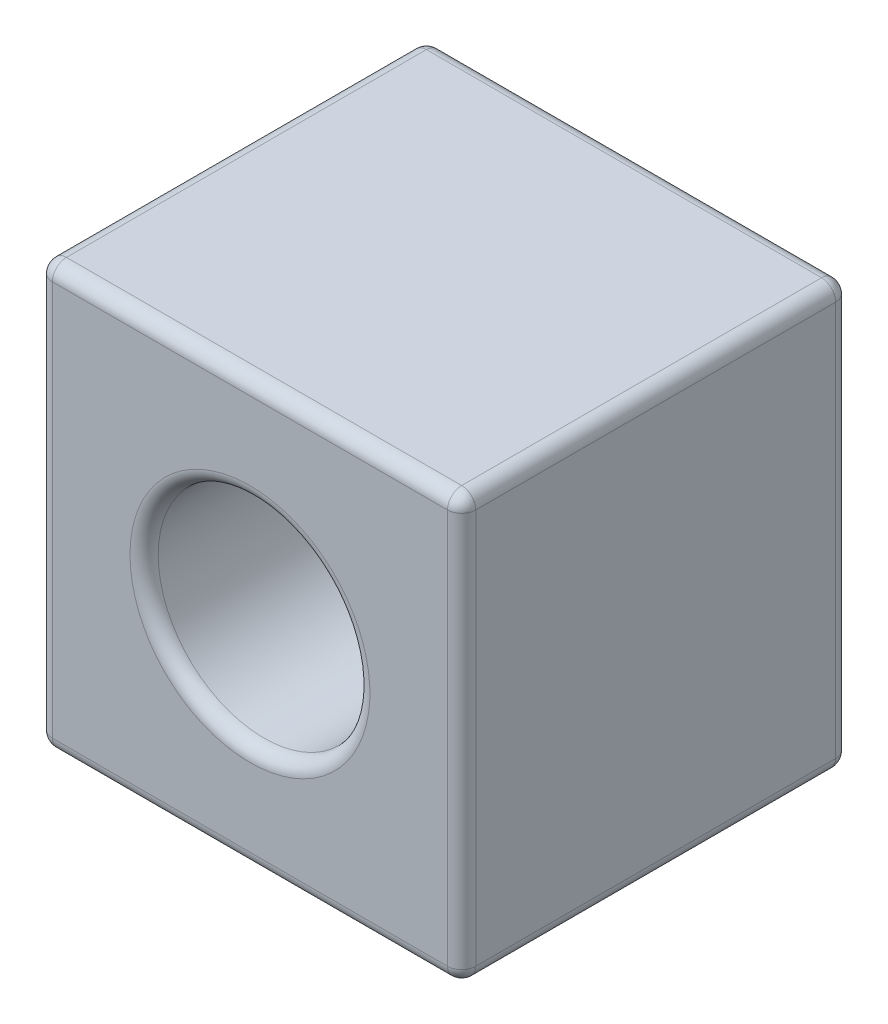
ISO-10303-21;
HEADER;
FILE_DESCRIPTION(('STEP AP214'),'2;1');
FILE_NAME('part.step','',(''),(''),'','','');
FILE_SCHEMA(('AUTOMOTIVE_DESIGN { 1 0 10303 214 1 1 1 1 }'));
ENDSEC;
DATA;
#1=APPLICATION_CONTEXT('core data for automotive mechanical design processes');
#2=APPLICATION_PROTOCOL_DEFINITION('international standard','automotive_design',2000,#1);
#3=PRODUCT_CONTEXT('',#1,'mechanical');
#4=PRODUCT('Part','Part','',(#3));
#5=PRODUCT_RELATED_PRODUCT_CATEGORY('part','',(#4));
#6=PRODUCT_DEFINITION_FORMATION('','',#4);
#7=PRODUCT_DEFINITION_CONTEXT('part definition',#1,'design');
#8=PRODUCT_DEFINITION('design','',#6,#7);
#9=PRODUCT_DEFINITION_SHAPE('','',#8);
#10=(LENGTH_UNIT() NAMED_UNIT(*) SI_UNIT(.MILLI.,.METRE.));
#11=(NAMED_UNIT(*) PLANE_ANGLE_UNIT() SI_UNIT($,.RADIAN.));
#12=(NAMED_UNIT(*) SI_UNIT($,.STERADIAN.) SOLID_ANGLE_UNIT());
#13=UNCERTAINTY_MEASURE_WITH_UNIT(LENGTH_MEASURE(1.E-05),#10,'distance_accuracy_value','');
#14=(GEOMETRIC_REPRESENTATION_CONTEXT(3) GLOBAL_UNCERTAINTY_ASSIGNED_CONTEXT((#13)) GLOBAL_UNIT_ASSIGNED_CONTEXT((#10,
#11,#12)) REPRESENTATION_CONTEXT('',''));
#15=CARTESIAN_POINT('',(0.,0.,0.));
#16=DIRECTION('',(0.,0.,1.));
#17=DIRECTION('',(1.,0.,0.));
#18=AXIS2_PLACEMENT_3D('',#15,#16,#17);
#19=CARTESIAN_POINT('',(-2.8,2.8,5.5));
#20=DIRECTION('',(0.,0.,-1.));
#21=DIRECTION('',(-1.,0.,0.));
#22=AXIS2_PLACEMENT_3D('',#19,#20,#21);
#23=PLANE('',#22);
#24=CARTESIAN_POINT('',(0.,0.,5.5));
#25=DIRECTION('',(0.,0.,-1.));
#26=DIRECTION('',(-1.,0.,0.));
#27=AXIS2_PLACEMENT_3D('',#24,#25,#26);
#28=CIRCLE('',#27,1.7);
#29=CARTESIAN_POINT('',(-1.7,0.,5.5));
#30=VERTEX_POINT('',#29);
#31=EDGE_CURVE('E11',#30,#30,#28,.T.);
#32=ORIENTED_EDGE('',*,*,#31,.T.);
#33=EDGE_LOOP('',(#32));
#34=FACE_BOUND('',#33,.T.);
#35=DIRECTION('',(0.,1.,0.));
#36=VECTOR('',#35,1.);
#37=CARTESIAN_POINT('',(2.8,2.8,5.5));
#38=LINE('',#37,#36);
#39=CARTESIAN_POINT('',(2.8,-2.8,5.5));
#40=VERTEX_POINT('',#39);
#41=CARTESIAN_POINT('',(2.8,2.8,5.5));
#42=VERTEX_POINT('',#41);
#43=EDGE_CURVE('E48',#40,#42,#38,.T.);
#44=ORIENTED_EDGE('',*,*,#43,.T.);
#45=DIRECTION('',(-1.,0.,0.));
#46=VECTOR('',#45,1.);
#47=CARTESIAN_POINT('',(-2.8,2.8,5.5));
#48=LINE('',#47,#46);
#49=CARTESIAN_POINT('',(-2.8,2.8,5.5));
#50=VERTEX_POINT('',#49);
#51=EDGE_CURVE('E41',#42,#50,#48,.T.);
#52=ORIENTED_EDGE('',*,*,#51,.T.);
#53=DIRECTION('',(0.,-1.,0.));
#54=VECTOR('',#53,1.);
#55=CARTESIAN_POINT('',(-2.8,2.8,5.5));
#56=LINE('',#55,#54);
#57=CARTESIAN_POINT('',(-2.8,-2.8,5.5));
#58=VERTEX_POINT('',#57);
#59=EDGE_CURVE('E204',#50,#58,#56,.T.);
#60=ORIENTED_EDGE('',*,*,#59,.T.);
#61=DIRECTION('',(1.,0.,0.));
#62=VECTOR('',#61,1.);
#63=CARTESIAN_POINT('',(-2.8,-2.8,5.5));
#64=LINE('',#63,#62);
#65=EDGE_CURVE('E53',#58,#40,#64,.T.);
#66=ORIENTED_EDGE('',*,*,#65,.T.);
#67=EDGE_LOOP('',(#44,#52,#60,#66));
#68=FACE_BOUND('',#67,.T.);
#69=ADVANCED_FACE('F33',(#34,#68),#23,.F.);
#70=CARTESIAN_POINT('',(-2.8,2.8,0.));
#71=DIRECTION('',(0.,0.,-1.));
#72=DIRECTION('',(-1.,0.,0.));
#73=AXIS2_PLACEMENT_3D('',#70,#71,#72);
#74=PLANE('',#73);
#75=CARTESIAN_POINT('',(0.,0.,0.));
#76=DIRECTION('',(0.,0.,-1.));
#77=DIRECTION('',(-1.,0.,0.));
#78=AXIS2_PLACEMENT_3D('',#75,#76,#77);
#79=CIRCLE('',#78,1.7);
#80=CARTESIAN_POINT('',(-1.7,0.,0.));
#81=VERTEX_POINT('',#80);
#82=EDGE_CURVE('E159',#81,#81,#79,.F.);
#83=ORIENTED_EDGE('',*,*,#82,.T.);
#84=EDGE_LOOP('',(#83));
#85=FACE_BOUND('',#84,.T.);
#86=DIRECTION('',(1.,0.,0.));
#87=VECTOR('',#86,1.);
#88=CARTESIAN_POINT('',(-2.8,-2.8,0.));
#89=LINE('',#88,#87);
#90=CARTESIAN_POINT('',(2.8,-2.8,0.));
#91=VERTEX_POINT('',#90);
#92=CARTESIAN_POINT('',(-2.8,-2.8,0.));
#93=VERTEX_POINT('',#92);
#94=EDGE_CURVE('E157',#91,#93,#89,.F.);
#95=ORIENTED_EDGE('',*,*,#94,.T.);
#96=DIRECTION('',(0.,-1.,0.));
#97=VECTOR('',#96,1.);
#98=CARTESIAN_POINT('',(-2.8,2.8,0.));
#99=LINE('',#98,#97);
#100=CARTESIAN_POINT('',(-2.8,2.8,0.));
#101=VERTEX_POINT('',#100);
#102=EDGE_CURVE('E127',#93,#101,#99,.F.);
#103=ORIENTED_EDGE('',*,*,#102,.T.);
#104=DIRECTION('',(-1.,0.,0.));
#105=VECTOR('',#104,1.);
#106=CARTESIAN_POINT('',(2.8,2.8,0.));
#107=LINE('',#106,#105);
#108=CARTESIAN_POINT('',(2.8,2.8,0.));
#109=VERTEX_POINT('',#108);
#110=EDGE_CURVE('E146',#101,#109,#107,.F.);
#111=ORIENTED_EDGE('',*,*,#110,.T.);
#112=DIRECTION('',(0.,1.,0.));
#113=VECTOR('',#112,1.);
#114=CARTESIAN_POINT('',(2.8,-2.8,0.));
#115=LINE('',#114,#113);
#116=EDGE_CURVE('E152',#109,#91,#115,.F.);
#117=ORIENTED_EDGE('',*,*,#116,.T.);
#118=EDGE_LOOP('',(#95,#103,#111,#117));
#119=FACE_BOUND('',#118,.T.);
#120=ADVANCED_FACE('F155',(#85,#119),#74,.T.);
#121=CARTESIAN_POINT('',(-2.8,2.8,5.5));
#122=DIRECTION('',(0.,0.,-1.));
#123=DIRECTION('',(-1.,0.,0.));
#124=AXIS2_PLACEMENT_3D('',#121,#122,#123);
#125=CYLINDRICAL_SURFACE('',#124,0.2);
#126=DIRECTION('',(0.,0.,-1.));
#127=VECTOR('',#126,1.);
#128=CARTESIAN_POINT('',(-2.8,3.,5.5));
#129=LINE('',#128,#127);
#130=CARTESIAN_POINT('',(-2.8,3.,5.3));
#131=VERTEX_POINT('',#130);
#132=CARTESIAN_POINT('',(-2.8,3.,0.2));
#133=VERTEX_POINT('',#132);
#134=EDGE_CURVE('E259',#131,#133,#129,.T.);
#135=ORIENTED_EDGE('',*,*,#134,.T.);
#136=CARTESIAN_POINT('',(-2.8,2.8,0.2));
#137=DIRECTION('',(0.,0.,-1.));
#138=DIRECTION('',(-1.,0.,0.));
#139=AXIS2_PLACEMENT_3D('',#136,#137,#138);
#140=CIRCLE('',#139,0.2);
#141=CARTESIAN_POINT('',(-3.,2.8,0.2));
#142=VERTEX_POINT('',#141);
#143=EDGE_CURVE('E140',#133,#142,#140,.F.);
#144=ORIENTED_EDGE('',*,*,#143,.T.);
#145=DIRECTION('',(0.,0.,-1.));
#146=VECTOR('',#145,1.);
#147=CARTESIAN_POINT('',(-3.,2.8,5.5));
#148=LINE('',#147,#146);
#149=CARTESIAN_POINT('',(-3.,2.8,5.3));
#150=VERTEX_POINT('',#149);
#151=EDGE_CURVE('E153',#150,#142,#148,.T.);
#152=ORIENTED_EDGE('',*,*,#151,.F.);
#153=CARTESIAN_POINT('',(-2.8,2.8,5.3));
#154=DIRECTION('',(0.,0.,-1.));
#155=DIRECTION('',(-1.,0.,0.));
#156=AXIS2_PLACEMENT_3D('',#153,#154,#155);
#157=CIRCLE('',#156,0.2);
#158=EDGE_CURVE('E201',#150,#131,#157,.T.);
#159=ORIENTED_EDGE('',*,*,#158,.T.);
#160=EDGE_LOOP('',(#135,#144,#152,#159));
#161=FACE_BOUND('',#160,.T.);
#162=ADVANCED_FACE('F35',(#161),#125,.T.);
#163=CARTESIAN_POINT('',(-3.,2.8,5.5));
#164=DIRECTION('',(1.,0.,0.));
#165=DIRECTION('',(0.,0.,-1.));
#166=AXIS2_PLACEMENT_3D('',#163,#164,#165);
#167=PLANE('',#166);
#168=ORIENTED_EDGE('',*,*,#151,.T.);
#169=DIRECTION('',(0.,-1.,0.));
#170=VECTOR('',#169,1.);
#171=CARTESIAN_POINT('',(-3.,-2.8,0.2));
#172=LINE('',#171,#170);
#173=CARTESIAN_POINT('',(-3.,-2.8,0.2));
#174=VERTEX_POINT('',#173);
#175=EDGE_CURVE('E130',#142,#174,#172,.T.);
#176=ORIENTED_EDGE('',*,*,#175,.T.);
#177=DIRECTION('',(0.,0.,-1.));
#178=VECTOR('',#177,1.);
#179=CARTESIAN_POINT('',(-3.,-2.8,5.5));
#180=LINE('',#179,#178);
#181=CARTESIAN_POINT('',(-3.,-2.8,5.3));
#182=VERTEX_POINT('',#181);
#183=EDGE_CURVE('E277',#182,#174,#180,.T.);
#184=ORIENTED_EDGE('',*,*,#183,.F.);
#185=DIRECTION('',(0.,-1.,0.));
#186=VECTOR('',#185,1.);
#187=CARTESIAN_POINT('',(-3.,2.8,5.3));
#188=LINE('',#187,#186);
#189=EDGE_CURVE('E173',#182,#150,#188,.F.);
#190=ORIENTED_EDGE('',*,*,#189,.T.);
#191=EDGE_LOOP('',(#168,#176,#184,#190));
#192=FACE_BOUND('',#191,.T.);
#193=ADVANCED_FACE('F300',(#192),#167,.F.);
#194=CARTESIAN_POINT('',(-2.8,-2.8,5.5));
#195=DIRECTION('',(0.,0.,-1.));
#196=DIRECTION('',(-1.,0.,0.));
#197=AXIS2_PLACEMENT_3D('',#194,#195,#196);
#198=CYLINDRICAL_SURFACE('',#197,0.2);
#199=ORIENTED_EDGE('',*,*,#183,.T.);
#200=CARTESIAN_POINT('',(-2.8,-2.8,0.2));
#201=DIRECTION('',(0.,0.,-1.));
#202=DIRECTION('',(-1.,0.,0.));
#203=AXIS2_PLACEMENT_3D('',#200,#201,#202);
#204=CIRCLE('',#203,0.2);
#205=CARTESIAN_POINT('',(-2.8,-3.,0.2));
#206=VERTEX_POINT('',#205);
#207=EDGE_CURVE('E178',#174,#206,#204,.F.);
#208=ORIENTED_EDGE('',*,*,#207,.T.);
#209=DIRECTION('',(0.,0.,-1.));
#210=VECTOR('',#209,1.);
#211=CARTESIAN_POINT('',(-2.8,-3.,5.5));
#212=LINE('',#211,#210);
#213=CARTESIAN_POINT('',(-2.8,-3.,5.3));
#214=VERTEX_POINT('',#213);
#215=EDGE_CURVE('E274',#214,#206,#212,.T.);
#216=ORIENTED_EDGE('',*,*,#215,.F.);
#217=CARTESIAN_POINT('',(-2.8,-2.8,5.3));
#218=DIRECTION('',(0.,0.,-1.));
#219=DIRECTION('',(-1.,0.,0.));
#220=AXIS2_PLACEMENT_3D('',#217,#218,#219);
#221=CIRCLE('',#220,0.2);
#222=EDGE_CURVE('E176',#214,#182,#221,.T.);
#223=ORIENTED_EDGE('',*,*,#222,.T.);
#224=EDGE_LOOP('',(#199,#208,#216,#223));
#225=FACE_BOUND('',#224,.T.);
#226=ADVANCED_FACE('F302',(#225),#198,.T.);
#227=CARTESIAN_POINT('',(-2.8,-3.,5.5));
#228=DIRECTION('',(0.,1.,0.));
#229=DIRECTION('',(0.,0.,1.));
#230=AXIS2_PLACEMENT_3D('',#227,#228,#229);
#231=PLANE('',#230);
#232=ORIENTED_EDGE('',*,*,#215,.T.);
#233=DIRECTION('',(1.,0.,0.));
#234=VECTOR('',#233,1.);
#235=CARTESIAN_POINT('',(2.8,-3.,0.2));
#236=LINE('',#235,#234);
#237=CARTESIAN_POINT('',(2.8,-3.,0.2));
#238=VERTEX_POINT('',#237);
#239=EDGE_CURVE('E182',#206,#238,#236,.T.);
#240=ORIENTED_EDGE('',*,*,#239,.T.);
#241=DIRECTION('',(0.,0.,-1.));
#242=VECTOR('',#241,1.);
#243=CARTESIAN_POINT('',(2.8,-3.,5.5));
#244=LINE('',#243,#242);
#245=CARTESIAN_POINT('',(2.8,-3.,5.3));
#246=VERTEX_POINT('',#245);
#247=EDGE_CURVE('E271',#246,#238,#244,.T.);
#248=ORIENTED_EDGE('',*,*,#247,.F.);
#249=DIRECTION('',(1.,0.,0.));
#250=VECTOR('',#249,1.);
#251=CARTESIAN_POINT('',(-2.8,-3.,5.3));
#252=LINE('',#251,#250);
#253=EDGE_CURVE('E180',#246,#214,#252,.F.);
#254=ORIENTED_EDGE('',*,*,#253,.T.);
#255=EDGE_LOOP('',(#232,#240,#248,#254));
#256=FACE_BOUND('',#255,.T.);
#257=ADVANCED_FACE('F355',(#256),#231,.F.);
#258=CARTESIAN_POINT('',(2.8,-2.8,5.5));
#259=DIRECTION('',(0.,0.,-1.));
#260=DIRECTION('',(-1.,0.,0.));
#261=AXIS2_PLACEMENT_3D('',#258,#259,#260);
#262=CYLINDRICAL_SURFACE('',#261,0.2);
#263=ORIENTED_EDGE('',*,*,#247,.T.);
#264=CARTESIAN_POINT('',(2.8,-2.8,0.2));
#265=DIRECTION('',(0.,0.,-1.));
#266=DIRECTION('',(-1.,0.,0.));
#267=AXIS2_PLACEMENT_3D('',#264,#265,#266);
#268=CIRCLE('',#267,0.2);
#269=CARTESIAN_POINT('',(3.,-2.8,0.2));
#270=VERTEX_POINT('',#269);
#271=EDGE_CURVE('E186',#238,#270,#268,.F.);
#272=ORIENTED_EDGE('',*,*,#271,.T.);
#273=DIRECTION('',(0.,0.,-1.));
#274=VECTOR('',#273,1.);
#275=CARTESIAN_POINT('',(3.,-2.8,5.5));
#276=LINE('',#275,#274);
#277=CARTESIAN_POINT('',(3.,-2.8,5.3));
#278=VERTEX_POINT('',#277);
#279=EDGE_CURVE('E268',#278,#270,#276,.T.);
#280=ORIENTED_EDGE('',*,*,#279,.F.);
#281=CARTESIAN_POINT('',(2.8,-2.8,5.3));
#282=DIRECTION('',(0.,0.,-1.));
#283=DIRECTION('',(-1.,0.,0.));
#284=AXIS2_PLACEMENT_3D('',#281,#282,#283);
#285=CIRCLE('',#284,0.2);
#286=EDGE_CURVE('E184',#278,#246,#285,.T.);
#287=ORIENTED_EDGE('',*,*,#286,.T.);
#288=EDGE_LOOP('',(#263,#272,#280,#287));
#289=FACE_BOUND('',#288,.T.);
#290=ADVANCED_FACE('F351',(#289),#262,.T.);
#291=CARTESIAN_POINT('',(3.,2.8,5.5));
#292=DIRECTION('',(-1.,0.,0.));
#293=DIRECTION('',(0.,0.,1.));
#294=AXIS2_PLACEMENT_3D('',#291,#292,#293);
#295=PLANE('',#294);
#296=ORIENTED_EDGE('',*,*,#279,.T.);
#297=DIRECTION('',(0.,1.,0.));
#298=VECTOR('',#297,1.);
#299=CARTESIAN_POINT('',(3.,2.8,0.2));
#300=LINE('',#299,#298);
#301=CARTESIAN_POINT('',(3.,2.8,0.2));
#302=VERTEX_POINT('',#301);
#303=EDGE_CURVE('E190',#270,#302,#300,.T.);
#304=ORIENTED_EDGE('',*,*,#303,.T.);
#305=DIRECTION('',(0.,0.,-1.));
#306=VECTOR('',#305,1.);
#307=CARTESIAN_POINT('',(3.,2.8,5.5));
#308=LINE('',#307,#306);
#309=CARTESIAN_POINT('',(3.,2.8,5.3));
#310=VERTEX_POINT('',#309);
#311=EDGE_CURVE('E265',#310,#302,#308,.T.);
#312=ORIENTED_EDGE('',*,*,#311,.F.);
#313=DIRECTION('',(0.,1.,0.));
#314=VECTOR('',#313,1.);
#315=CARTESIAN_POINT('',(3.,2.8,5.3));
#316=LINE('',#315,#314);
#317=EDGE_CURVE('E188',#310,#278,#316,.F.);
#318=ORIENTED_EDGE('',*,*,#317,.T.);
#319=EDGE_LOOP('',(#296,#304,#312,#318));
#320=FACE_BOUND('',#319,.T.);
#321=ADVANCED_FACE('F348',(#320),#295,.F.);
#322=CARTESIAN_POINT('',(2.8,2.8,5.5));
#323=DIRECTION('',(0.,0.,-1.));
#324=DIRECTION('',(-1.,0.,0.));
#325=AXIS2_PLACEMENT_3D('',#322,#323,#324);
#326=CYLINDRICAL_SURFACE('',#325,0.2);
#327=ORIENTED_EDGE('',*,*,#311,.T.);
#328=CARTESIAN_POINT('',(2.8,2.8,0.2));
#329=DIRECTION('',(0.,0.,-1.));
#330=DIRECTION('',(-1.,0.,0.));
#331=AXIS2_PLACEMENT_3D('',#328,#329,#330);
#332=CIRCLE('',#331,0.2);
#333=CARTESIAN_POINT('',(2.8,3.,0.2));
#334=VERTEX_POINT('',#333);
#335=EDGE_CURVE('E194',#302,#334,#332,.F.);
#336=ORIENTED_EDGE('',*,*,#335,.T.);
#337=DIRECTION('',(0.,0.,-1.));
#338=VECTOR('',#337,1.);
#339=CARTESIAN_POINT('',(2.8,3.,5.5));
#340=LINE('',#339,#338);
#341=CARTESIAN_POINT('',(2.8,3.,5.3));
#342=VERTEX_POINT('',#341);
#343=EDGE_CURVE('E262',#342,#334,#340,.T.);
#344=ORIENTED_EDGE('',*,*,#343,.F.);
#345=CARTESIAN_POINT('',(2.8,2.8,5.3));
#346=DIRECTION('',(0.,0.,-1.));
#347=DIRECTION('',(-1.,0.,0.));
#348=AXIS2_PLACEMENT_3D('',#345,#346,#347);
#349=CIRCLE('',#348,0.2);
#350=EDGE_CURVE('E192',#342,#310,#349,.T.);
#351=ORIENTED_EDGE('',*,*,#350,.T.);
#352=EDGE_LOOP('',(#327,#336,#344,#351));
#353=FACE_BOUND('',#352,.T.);
#354=ADVANCED_FACE('F324',(#353),#326,.T.);
#355=CARTESIAN_POINT('',(-2.8,3.,5.5));
#356=DIRECTION('',(0.,-1.,0.));
#357=DIRECTION('',(0.,0.,-1.));
#358=AXIS2_PLACEMENT_3D('',#355,#356,#357);
#359=PLANE('',#358);
#360=ORIENTED_EDGE('',*,*,#343,.T.);
#361=DIRECTION('',(-1.,0.,0.));
#362=VECTOR('',#361,1.);
#363=CARTESIAN_POINT('',(-2.8,3.,0.2));
#364=LINE('',#363,#362);
#365=EDGE_CURVE('E199',#334,#133,#364,.T.);
#366=ORIENTED_EDGE('',*,*,#365,.T.);
#367=ORIENTED_EDGE('',*,*,#134,.F.);
#368=DIRECTION('',(-1.,0.,0.));
#369=VECTOR('',#368,1.);
#370=CARTESIAN_POINT('',(-2.8,3.,5.3));
#371=LINE('',#370,#369);
#372=EDGE_CURVE('E196',#131,#342,#371,.F.);
#373=ORIENTED_EDGE('',*,*,#372,.T.);
#374=EDGE_LOOP('',(#360,#366,#367,#373));
#375=FACE_BOUND('',#374,.T.);
#376=ADVANCED_FACE('F323',(#375),#359,.F.);
#377=CARTESIAN_POINT('',(0.,0.,5.5));
#378=DIRECTION('',(0.,0.,-1.));
#379=DIRECTION('',(-1.,0.,0.));
#380=AXIS2_PLACEMENT_3D('',#377,#378,#379);
#381=CYLINDRICAL_SURFACE('',#380,1.5);
#382=CARTESIAN_POINT('',(0.,0.,0.2));
#383=DIRECTION('',(0.,0.,-1.));
#384=DIRECTION('',(-1.,0.,0.));
#385=AXIS2_PLACEMENT_3D('',#382,#383,#384);
#386=CIRCLE('',#385,1.5);
#387=CARTESIAN_POINT('',(-1.5,0.,0.2));
#388=VERTEX_POINT('',#387);
#389=EDGE_CURVE('E169',#388,#388,#386,.T.);
#390=ORIENTED_EDGE('',*,*,#389,.T.);
#391=EDGE_LOOP('',(#390));
#392=FACE_BOUND('',#391,.T.);
#393=CARTESIAN_POINT('',(0.,0.,5.3));
#394=DIRECTION('',(0.,0.,-1.));
#395=DIRECTION('',(-1.,0.,0.));
#396=AXIS2_PLACEMENT_3D('',#393,#394,#395);
#397=CIRCLE('',#396,1.5);
#398=CARTESIAN_POINT('',(-1.5,0.,5.3));
#399=VERTEX_POINT('',#398);
#400=EDGE_CURVE('E162',#399,#399,#397,.F.);
#401=ORIENTED_EDGE('',*,*,#400,.T.);
#402=EDGE_LOOP('',(#401));
#403=FACE_BOUND('',#402,.T.);
#404=ADVANCED_FACE('F345',(#392,#403),#381,.F.);
#405=CARTESIAN_POINT('',(0.,0.,0.2));
#406=DIRECTION('',(0.,0.,-1.));
#407=DIRECTION('',(-1.,0.,0.));
#408=AXIS2_PLACEMENT_3D('',#405,#406,#407);
#409=TOROIDAL_SURFACE('',#408,1.7,0.2);
#410=ORIENTED_EDGE('',*,*,#389,.F.);
#411=EDGE_LOOP('',(#410));
#412=FACE_BOUND('',#411,.T.);
#413=ORIENTED_EDGE('',*,*,#82,.F.);
#414=EDGE_LOOP('',(#413));
#415=FACE_BOUND('',#414,.T.);
#416=ADVANCED_FACE('F392',(#412,#415),#409,.T.);
#417=CARTESIAN_POINT('',(2.8,2.8,0.2));
#418=DIRECTION('',(0.,-1.,0.));
#419=DIRECTION('',(0.,0.,-1.));
#420=AXIS2_PLACEMENT_3D('',#417,#418,#419);
#421=CYLINDRICAL_SURFACE('',#420,0.2);
#422=CARTESIAN_POINT('',(2.8,2.8,0.2));
#423=DIRECTION('',(0.,1.,0.));
#424=DIRECTION('',(0.,0.,1.));
#425=AXIS2_PLACEMENT_3D('',#422,#423,#424);
#426=CIRCLE('',#425,0.2);
#427=EDGE_CURVE('E256',#302,#109,#426,.T.);
#428=ORIENTED_EDGE('',*,*,#427,.F.);
#429=ORIENTED_EDGE('',*,*,#303,.F.);
#430=CARTESIAN_POINT('',(2.8,-2.8,0.2));
#431=DIRECTION('',(0.,-1.,0.));
#432=DIRECTION('',(1.,0.,0.));
#433=AXIS2_PLACEMENT_3D('',#430,#431,#432);
#434=CIRCLE('',#433,0.2);
#435=EDGE_CURVE('E253',#91,#270,#434,.T.);
#436=ORIENTED_EDGE('',*,*,#435,.F.);
#437=ORIENTED_EDGE('',*,*,#116,.F.);
#438=EDGE_LOOP('',(#428,#429,#436,#437));
#439=FACE_BOUND('',#438,.T.);
#440=ADVANCED_FACE('F286',(#439),#421,.T.);
#441=CARTESIAN_POINT('',(2.8,2.8,0.2));
#442=DIRECTION('',(0.,0.,1.));
#443=DIRECTION('',(1.,0.,0.));
#444=AXIS2_PLACEMENT_3D('',#441,#442,#443);
#445=SPHERICAL_SURFACE('',#444,0.2);
#446=ORIENTED_EDGE('',*,*,#335,.F.);
#447=ORIENTED_EDGE('',*,*,#427,.T.);
#448=CARTESIAN_POINT('',(2.8,2.8,0.2));
#449=DIRECTION('',(-1.,0.,0.));
#450=DIRECTION('',(0.,-1.,0.));
#451=AXIS2_PLACEMENT_3D('',#448,#449,#450);
#452=CIRCLE('',#451,0.2);
#453=EDGE_CURVE('E149',#334,#109,#452,.T.);
#454=ORIENTED_EDGE('',*,*,#453,.F.);
#455=EDGE_LOOP('',(#446,#447,#454));
#456=FACE_BOUND('',#455,.T.);
#457=ADVANCED_FACE('F327',(#456),#445,.T.);
#458=CARTESIAN_POINT('',(2.8,-2.8,0.2));
#459=DIRECTION('',(0.,0.,1.));
#460=DIRECTION('',(1.,0.,0.));
#461=AXIS2_PLACEMENT_3D('',#458,#459,#460);
#462=SPHERICAL_SURFACE('',#461,0.2);
#463=ORIENTED_EDGE('',*,*,#435,.T.);
#464=ORIENTED_EDGE('',*,*,#271,.F.);
#465=CARTESIAN_POINT('',(2.8,-2.8,0.2));
#466=DIRECTION('',(-1.,0.,0.));
#467=DIRECTION('',(0.,-1.,0.));
#468=AXIS2_PLACEMENT_3D('',#465,#466,#467);
#469=CIRCLE('',#468,0.2);
#470=EDGE_CURVE('E143',#91,#238,#469,.T.);
#471=ORIENTED_EDGE('',*,*,#470,.F.);
#472=EDGE_LOOP('',(#463,#464,#471));
#473=FACE_BOUND('',#472,.T.);
#474=ADVANCED_FACE('F289',(#473),#462,.T.);
#475=CARTESIAN_POINT('',(-2.8,2.8,0.2));
#476=DIRECTION('',(1.,0.,0.));
#477=DIRECTION('',(0.,0.,-1.));
#478=AXIS2_PLACEMENT_3D('',#475,#476,#477);
#479=CYLINDRICAL_SURFACE('',#478,0.2);
#480=ORIENTED_EDGE('',*,*,#453,.T.);
#481=ORIENTED_EDGE('',*,*,#110,.F.);
#482=CARTESIAN_POINT('',(-2.8,2.8,0.2));
#483=DIRECTION('',(-1.,0.,0.));
#484=DIRECTION('',(0.,0.,1.));
#485=AXIS2_PLACEMENT_3D('',#482,#483,#484);
#486=CIRCLE('',#485,0.2);
#487=EDGE_CURVE('E137',#133,#101,#486,.T.);
#488=ORIENTED_EDGE('',*,*,#487,.F.);
#489=ORIENTED_EDGE('',*,*,#365,.F.);
#490=EDGE_LOOP('',(#480,#481,#488,#489));
#491=FACE_BOUND('',#490,.T.);
#492=ADVANCED_FACE('F147',(#491),#479,.T.);
#493=CARTESIAN_POINT('',(-2.8,-2.8,0.2));
#494=DIRECTION('',(-1.,0.,0.));
#495=DIRECTION('',(0.,0.,1.));
#496=AXIS2_PLACEMENT_3D('',#493,#494,#495);
#497=CYLINDRICAL_SURFACE('',#496,0.2);
#498=ORIENTED_EDGE('',*,*,#470,.T.);
#499=ORIENTED_EDGE('',*,*,#239,.F.);
#500=CARTESIAN_POINT('',(-2.8,-2.8,0.2));
#501=DIRECTION('',(-1.,0.,0.));
#502=DIRECTION('',(0.,-1.,0.));
#503=AXIS2_PLACEMENT_3D('',#500,#501,#502);
#504=CIRCLE('',#503,0.2);
#505=EDGE_CURVE('E133',#93,#206,#504,.T.);
#506=ORIENTED_EDGE('',*,*,#505,.F.);
#507=ORIENTED_EDGE('',*,*,#94,.F.);
#508=EDGE_LOOP('',(#498,#499,#506,#507));
#509=FACE_BOUND('',#508,.T.);
#510=ADVANCED_FACE('F292',(#509),#497,.T.);
#511=CARTESIAN_POINT('',(-2.8,2.8,0.2));
#512=DIRECTION('',(0.,0.,1.));
#513=DIRECTION('',(1.,0.,0.));
#514=AXIS2_PLACEMENT_3D('',#511,#512,#513);
#515=SPHERICAL_SURFACE('',#514,0.2);
#516=ORIENTED_EDGE('',*,*,#143,.F.);
#517=ORIENTED_EDGE('',*,*,#487,.T.);
#518=CARTESIAN_POINT('',(-2.8,2.8,0.2));
#519=DIRECTION('',(0.,-1.,0.));
#520=DIRECTION('',(1.,0.,0.));
#521=AXIS2_PLACEMENT_3D('',#518,#519,#520);
#522=CIRCLE('',#521,0.2);
#523=EDGE_CURVE('E123',#142,#101,#522,.T.);
#524=ORIENTED_EDGE('',*,*,#523,.F.);
#525=EDGE_LOOP('',(#516,#517,#524));
#526=FACE_BOUND('',#525,.T.);
#527=ADVANCED_FACE('F139',(#526),#515,.T.);
#528=CARTESIAN_POINT('',(-2.8,-2.8,0.2));
#529=DIRECTION('',(0.,0.,1.));
#530=DIRECTION('',(1.,0.,0.));
#531=AXIS2_PLACEMENT_3D('',#528,#529,#530);
#532=SPHERICAL_SURFACE('',#531,0.2);
#533=ORIENTED_EDGE('',*,*,#505,.T.);
#534=ORIENTED_EDGE('',*,*,#207,.F.);
#535=CARTESIAN_POINT('',(-2.8,-2.8,0.2));
#536=DIRECTION('',(0.,1.,0.));
#537=DIRECTION('',(-1.,0.,0.));
#538=AXIS2_PLACEMENT_3D('',#535,#536,#537);
#539=CIRCLE('',#538,0.2);
#540=EDGE_CURVE('E134',#93,#174,#539,.T.);
#541=ORIENTED_EDGE('',*,*,#540,.F.);
#542=EDGE_LOOP('',(#533,#534,#541));
#543=FACE_BOUND('',#542,.T.);
#544=ADVANCED_FACE('F295',(#543),#532,.T.);
#545=CARTESIAN_POINT('',(-2.8,2.8,0.2));
#546=DIRECTION('',(0.,1.,0.));
#547=DIRECTION('',(0.,0.,1.));
#548=AXIS2_PLACEMENT_3D('',#545,#546,#547);
#549=CYLINDRICAL_SURFACE('',#548,0.2);
#550=ORIENTED_EDGE('',*,*,#523,.T.);
#551=ORIENTED_EDGE('',*,*,#102,.F.);
#552=ORIENTED_EDGE('',*,*,#540,.T.);
#553=ORIENTED_EDGE('',*,*,#175,.F.);
#554=EDGE_LOOP('',(#550,#551,#552,#553));
#555=FACE_BOUND('',#554,.T.);
#556=ADVANCED_FACE('F125',(#555),#549,.T.);
#557=CARTESIAN_POINT('',(0.,0.,5.3));
#558=DIRECTION('',(0.,0.,-1.));
#559=DIRECTION('',(-1.,0.,0.));
#560=AXIS2_PLACEMENT_3D('',#557,#558,#559);
#561=TOROIDAL_SURFACE('',#560,1.7,0.2);
#562=ORIENTED_EDGE('',*,*,#31,.F.);
#563=EDGE_LOOP('',(#562));
#564=FACE_BOUND('',#563,.T.);
#565=ORIENTED_EDGE('',*,*,#400,.F.);
#566=EDGE_LOOP('',(#565));
#567=FACE_BOUND('',#566,.T.);
#568=ADVANCED_FACE('F447',(#564,#567),#561,.T.);
#569=CARTESIAN_POINT('',(-2.8,-2.8,5.3));
#570=DIRECTION('',(1.,0.,0.));
#571=DIRECTION('',(0.,0.,-1.));
#572=AXIS2_PLACEMENT_3D('',#569,#570,#571);
#573=CYLINDRICAL_SURFACE('',#572,0.2);
#574=CARTESIAN_POINT('',(-2.8,-2.8,5.3));
#575=DIRECTION('',(-1.,0.,0.));
#576=DIRECTION('',(0.,0.,1.));
#577=AXIS2_PLACEMENT_3D('',#574,#575,#576);
#578=CIRCLE('',#577,0.2);
#579=EDGE_CURVE('E238',#214,#58,#578,.T.);
#580=ORIENTED_EDGE('',*,*,#579,.F.);
#581=ORIENTED_EDGE('',*,*,#253,.F.);
#582=CARTESIAN_POINT('',(2.8,-2.8,5.3));
#583=DIRECTION('',(1.,0.,0.));
#584=DIRECTION('',(0.,1.,0.));
#585=AXIS2_PLACEMENT_3D('',#582,#583,#584);
#586=CIRCLE('',#585,0.2);
#587=EDGE_CURVE('E244',#40,#246,#586,.T.);
#588=ORIENTED_EDGE('',*,*,#587,.F.);
#589=ORIENTED_EDGE('',*,*,#65,.F.);
#590=EDGE_LOOP('',(#580,#581,#588,#589));
#591=FACE_BOUND('',#590,.T.);
#592=ADVANCED_FACE('F307',(#591),#573,.T.);
#593=CARTESIAN_POINT('',(2.8,-2.8,5.3));
#594=DIRECTION('',(0.,0.,1.));
#595=DIRECTION('',(1.,0.,0.));
#596=AXIS2_PLACEMENT_3D('',#593,#594,#595);
#597=SPHERICAL_SURFACE('',#596,0.2);
#598=ORIENTED_EDGE('',*,*,#587,.T.);
#599=ORIENTED_EDGE('',*,*,#286,.F.);
#600=CARTESIAN_POINT('',(2.8,-2.8,5.3));
#601=DIRECTION('',(0.,1.,0.));
#602=DIRECTION('',(-1.,0.,0.));
#603=AXIS2_PLACEMENT_3D('',#600,#601,#602);
#604=CIRCLE('',#603,0.2);
#605=EDGE_CURVE('E235',#40,#278,#604,.T.);
#606=ORIENTED_EDGE('',*,*,#605,.F.);
#607=EDGE_LOOP('',(#598,#599,#606));
#608=FACE_BOUND('',#607,.T.);
#609=ADVANCED_FACE('F311',(#608),#597,.T.);
#610=CARTESIAN_POINT('',(-2.8,-2.8,5.3));
#611=DIRECTION('',(0.,0.,1.));
#612=DIRECTION('',(1.,0.,0.));
#613=AXIS2_PLACEMENT_3D('',#610,#611,#612);
#614=SPHERICAL_SURFACE('',#613,0.2);
#615=ORIENTED_EDGE('',*,*,#222,.F.);
#616=ORIENTED_EDGE('',*,*,#579,.T.);
#617=CARTESIAN_POINT('',(-2.8,-2.8,5.3));
#618=DIRECTION('',(0.,1.,0.));
#619=DIRECTION('',(-1.,0.,0.));
#620=AXIS2_PLACEMENT_3D('',#617,#618,#619);
#621=CIRCLE('',#620,0.2);
#622=EDGE_CURVE('E231',#182,#58,#621,.T.);
#623=ORIENTED_EDGE('',*,*,#622,.F.);
#624=EDGE_LOOP('',(#615,#616,#623));
#625=FACE_BOUND('',#624,.T.);
#626=ADVANCED_FACE('F304',(#625),#614,.T.);
#627=CARTESIAN_POINT('',(2.8,2.8,5.3));
#628=DIRECTION('',(0.,1.,0.));
#629=DIRECTION('',(0.,0.,1.));
#630=AXIS2_PLACEMENT_3D('',#627,#628,#629);
#631=CYLINDRICAL_SURFACE('',#630,0.2);
#632=ORIENTED_EDGE('',*,*,#605,.T.);
#633=ORIENTED_EDGE('',*,*,#317,.F.);
#634=CARTESIAN_POINT('',(2.8,2.8,5.3));
#635=DIRECTION('',(0.,1.,0.));
#636=DIRECTION('',(-1.,0.,0.));
#637=AXIS2_PLACEMENT_3D('',#634,#635,#636);
#638=CIRCLE('',#637,0.2);
#639=EDGE_CURVE('E226',#42,#310,#638,.T.);
#640=ORIENTED_EDGE('',*,*,#639,.F.);
#641=ORIENTED_EDGE('',*,*,#43,.F.);
#642=EDGE_LOOP('',(#632,#633,#640,#641));
#643=FACE_BOUND('',#642,.T.);
#644=ADVANCED_FACE('F314',(#643),#631,.T.);
#645=CARTESIAN_POINT('',(-2.8,2.8,5.3));
#646=DIRECTION('',(0.,-1.,0.));
#647=DIRECTION('',(0.,0.,-1.));
#648=AXIS2_PLACEMENT_3D('',#645,#646,#647);
#649=CYLINDRICAL_SURFACE('',#648,0.2);
#650=ORIENTED_EDGE('',*,*,#622,.T.);
#651=ORIENTED_EDGE('',*,*,#59,.F.);
#652=CARTESIAN_POINT('',(-2.8,2.8,5.3));
#653=DIRECTION('',(0.,1.,0.));
#654=DIRECTION('',(0.,0.,1.));
#655=AXIS2_PLACEMENT_3D('',#652,#653,#654);
#656=CIRCLE('',#655,0.2);
#657=EDGE_CURVE('E222',#150,#50,#656,.T.);
#658=ORIENTED_EDGE('',*,*,#657,.F.);
#659=ORIENTED_EDGE('',*,*,#189,.F.);
#660=EDGE_LOOP('',(#650,#651,#658,#659));
#661=FACE_BOUND('',#660,.T.);
#662=ADVANCED_FACE('F229',(#661),#649,.T.);
#663=CARTESIAN_POINT('',(2.8,2.8,5.3));
#664=DIRECTION('',(0.,0.,1.));
#665=DIRECTION('',(1.,0.,0.));
#666=AXIS2_PLACEMENT_3D('',#663,#664,#665);
#667=SPHERICAL_SURFACE('',#666,0.2);
#668=ORIENTED_EDGE('',*,*,#639,.T.);
#669=ORIENTED_EDGE('',*,*,#350,.F.);
#670=CARTESIAN_POINT('',(2.8,2.8,5.3));
#671=DIRECTION('',(-1.,0.,0.));
#672=DIRECTION('',(0.,-1.,0.));
#673=AXIS2_PLACEMENT_3D('',#670,#671,#672);
#674=CIRCLE('',#673,0.2);
#675=EDGE_CURVE('E213',#42,#342,#674,.T.);
#676=ORIENTED_EDGE('',*,*,#675,.F.);
#677=EDGE_LOOP('',(#668,#669,#676));
#678=FACE_BOUND('',#677,.T.);
#679=ADVANCED_FACE('F316',(#678),#667,.T.);
#680=CARTESIAN_POINT('',(-2.8,2.8,5.3));
#681=DIRECTION('',(0.,0.,1.));
#682=DIRECTION('',(1.,0.,0.));
#683=AXIS2_PLACEMENT_3D('',#680,#681,#682);
#684=SPHERICAL_SURFACE('',#683,0.2);
#685=ORIENTED_EDGE('',*,*,#158,.F.);
#686=ORIENTED_EDGE('',*,*,#657,.T.);
#687=CARTESIAN_POINT('',(-2.8,2.8,5.3));
#688=DIRECTION('',(1.,0.,0.));
#689=DIRECTION('',(0.,1.,0.));
#690=AXIS2_PLACEMENT_3D('',#687,#688,#689);
#691=CIRCLE('',#690,0.2);
#692=EDGE_CURVE('E216',#131,#50,#691,.T.);
#693=ORIENTED_EDGE('',*,*,#692,.F.);
#694=EDGE_LOOP('',(#685,#686,#693));
#695=FACE_BOUND('',#694,.T.);
#696=ADVANCED_FACE('F223',(#695),#684,.T.);
#697=CARTESIAN_POINT('',(-2.8,2.8,5.3));
#698=DIRECTION('',(-1.,0.,0.));
#699=DIRECTION('',(0.,0.,1.));
#700=AXIS2_PLACEMENT_3D('',#697,#698,#699);
#701=CYLINDRICAL_SURFACE('',#700,0.2);
#702=ORIENTED_EDGE('',*,*,#675,.T.);
#703=ORIENTED_EDGE('',*,*,#372,.F.);
#704=ORIENTED_EDGE('',*,*,#692,.T.);
#705=ORIENTED_EDGE('',*,*,#51,.F.);
#706=EDGE_LOOP('',(#702,#703,#704,#705));
#707=FACE_BOUND('',#706,.T.);
#708=ADVANCED_FACE('F210',(#707),#701,.T.);
#709=CLOSED_SHELL('',(#69,#120,#162,#193,#226,#257,#290,#321,#354,#376,#404,#416,#440,#457,#474,
#492,#510,#527,#544,#556,#568,#592,#609,#626,#644,#662,#679,#696,#708));
#710=MANIFOLD_SOLID_BREP('B2',#709);
#711=ADVANCED_BREP_SHAPE_REPRESENTATION('',(#18,#710),#14);
#712=SHAPE_DEFINITION_REPRESENTATION(#9,#711);
ENDSEC;
END-ISO-10303-21;
